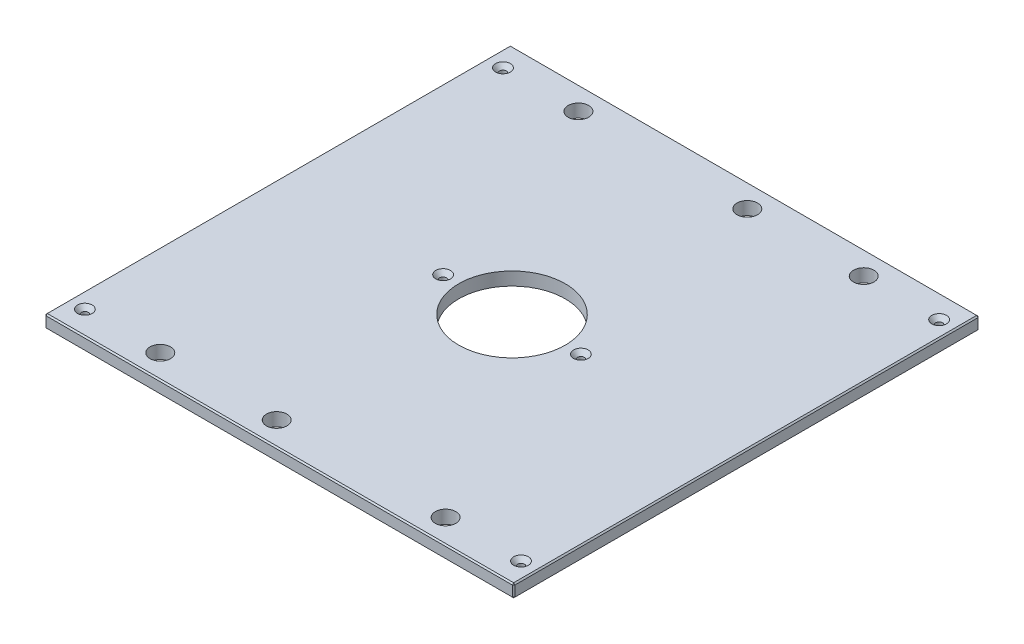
from build123d import *

# Parameters (mm, degrees)
SKETCH1_W                                        = 454.025
SKETCH1_H                                        = 450.85
BOSS_EXTRUDE1_DEPTH                              = 12.7
SKETCH13_R                                       = 51.562
CUT_EXTRUDE6_DEPTH                               = 321.175570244
F_25_32_0_78125_DIAMETER_HOLE1_D                 = 19.84375
CHAMFER2_SIZE                                    = 1.27
CSK_FOR_1_4_FLAT_HEAD_MACHINE_SCREW1_D           = 6.7564
CSK_FOR_1_4_FLAT_HEAD_MACHINE_SCREW1_CSINK_D     = 14.2748
CSK_FOR_1_4_FLAT_HEAD_MACHINE_SCREW1_CSINK_ANGLE = 82


with BuildPart() as part:
    # Sketch1 → Boss-Extrude1 (new body)
    with BuildSketch(Plane(origin=(0, 0, 0), x_dir=(1, 0, 0), z_dir=(0, 1, 0))):
        Rectangle(SKETCH1_W, SKETCH1_H)
    extrude(amount=BOSS_EXTRUDE1_DEPTH)

    # Sketch13 → Cut-Extrude6 (cut, through all)
    with BuildSketch(Plane(origin=(0, 12.7, 0), x_dir=(1, 0, 0), z_dir=(0, 1, 0))):
        with Locations(Location((0, 0, 0), (0, 0, 270))):
            Circle(SKETCH13_R)
    extrude(amount=-CUT_EXTRUDE6_DEPTH, mode=Mode.SUBTRACT)

    # 25_32 _0.78125_ Diameter Hole1 (through all)
    with Locations(Plane(origin=(0, 12.7, 0), x_dir=(1, 0, 0), z_dir=(0, 1, 0))):
        with Locations((138.1125, 202.40498), (-138.1125, 202.40498), (138.1125, -202.40498), (-138.1125, -202.40498), (25.4, 202.40498), (-25.4, -202.40498)):
            Hole(F_25_32_0_78125_DIAMETER_HOLE1_D / 2)

    # Chamfer2
    chamfer2_edges = [part.edges().sort_by_distance(p)[0] for p in [
        (227.0125, 12.7, 0),
        (0, 12.7, -225.425),
        (-227.0125, 12.7, 0),
        (0, 0, -225.425),
        (227.0125, 0, 0),
        (0, 0, 225.425),
        (-227.0125, 0, 0),
        (0, 12.7, 225.425),
        (-227.0125, 6.35, -225.425),
        (227.0125, 6.35, -225.425),
        (227.0125, 6.35, 225.425),
        (-227.0125, 6.35, 225.425),
    ]]
    chamfer(chamfer2_edges, length=CHAMFER2_SIZE)

    # CSK for 1_4 Flat Head Machine Screw1 (through all)
    with Locations(Plane(origin=(0, 12.7, 0), x_dir=(1, 0, 0), z_dir=(0, 1, 0))):
        with Locations((211.1375, 202.40498), (211.1375, -202.40498), (-211.1375, -202.40498), (-66.675, 0), (66.675, 0), (-211.1375, 202.40498), (-138.1125, 202.40498), (-138.1125, -202.40498)):
            CounterSinkHole(CSK_FOR_1_4_FLAT_HEAD_MACHINE_SCREW1_D / 2, CSK_FOR_1_4_FLAT_HEAD_MACHINE_SCREW1_CSINK_D / 2, counter_sink_angle=CSK_FOR_1_4_FLAT_HEAD_MACHINE_SCREW1_CSINK_ANGLE)


solid = part.part
